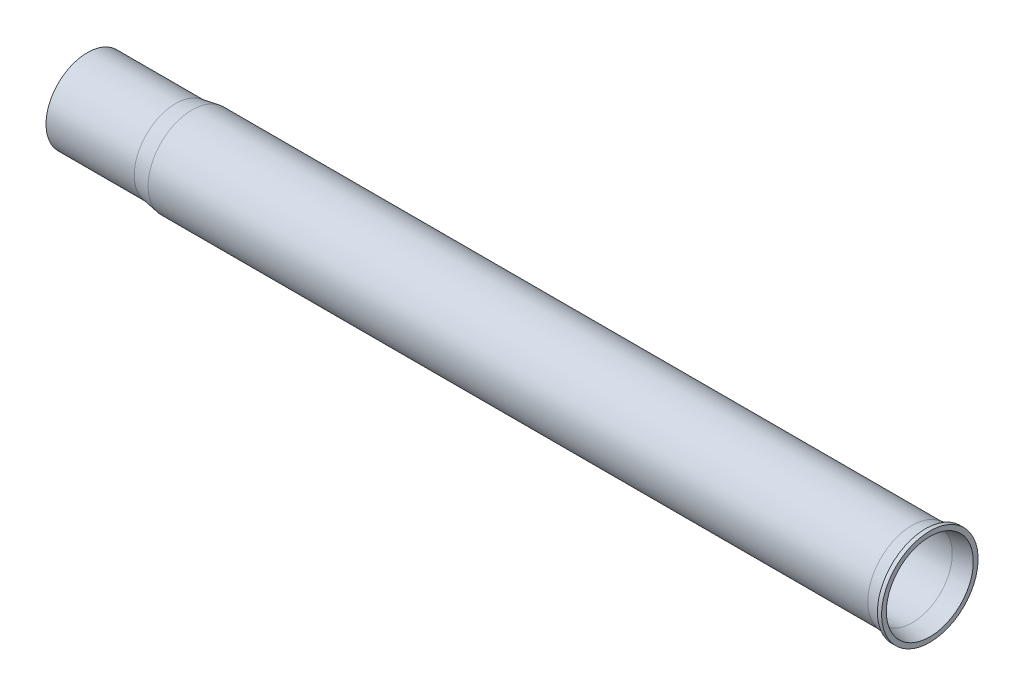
ISO-10303-21;
HEADER;
FILE_DESCRIPTION(('STEP AP214'),'2;1');
FILE_NAME('part.step','',(''),(''),'','','');
FILE_SCHEMA(('AUTOMOTIVE_DESIGN { 1 0 10303 214 1 1 1 1 }'));
ENDSEC;
DATA;
#1=APPLICATION_CONTEXT('core data for automotive mechanical design processes');
#2=APPLICATION_PROTOCOL_DEFINITION('international standard','automotive_design',2000,#1);
#3=PRODUCT_CONTEXT('',#1,'mechanical');
#4=PRODUCT('Part','Part','',(#3));
#5=PRODUCT_RELATED_PRODUCT_CATEGORY('part','',(#4));
#6=PRODUCT_DEFINITION_FORMATION('','',#4);
#7=PRODUCT_DEFINITION_CONTEXT('part definition',#1,'design');
#8=PRODUCT_DEFINITION('design','',#6,#7);
#9=PRODUCT_DEFINITION_SHAPE('','',#8);
#10=(LENGTH_UNIT() NAMED_UNIT(*) SI_UNIT(.MILLI.,.METRE.));
#11=(NAMED_UNIT(*) PLANE_ANGLE_UNIT() SI_UNIT($,.RADIAN.));
#12=(NAMED_UNIT(*) SI_UNIT($,.STERADIAN.) SOLID_ANGLE_UNIT());
#13=UNCERTAINTY_MEASURE_WITH_UNIT(LENGTH_MEASURE(1.E-05),#10,'distance_accuracy_value','');
#14=(GEOMETRIC_REPRESENTATION_CONTEXT(3) GLOBAL_UNCERTAINTY_ASSIGNED_CONTEXT((#13)) GLOBAL_UNIT_ASSIGNED_CONTEXT((#10,
#11,#12)) REPRESENTATION_CONTEXT('',''));
#15=CARTESIAN_POINT('',(0.,0.,0.));
#16=DIRECTION('',(0.,0.,1.));
#17=DIRECTION('',(1.,0.,0.));
#18=AXIS2_PLACEMENT_3D('',#15,#16,#17);
#19=CARTESIAN_POINT('',(0.,15.,0.));
#20=DIRECTION('',(1.,0.,0.));
#21=DIRECTION('',(0.,0.,-1.));
#22=AXIS2_PLACEMENT_3D('',#19,#20,#21);
#23=PLANE('',#22);
#24=CARTESIAN_POINT('',(0.,0.,0.));
#25=DIRECTION('',(-1.,0.,0.));
#26=DIRECTION('',(0.,0.,1.));
#27=AXIS2_PLACEMENT_3D('',#24,#25,#26);
#28=CIRCLE('',#27,13.5);
#29=CARTESIAN_POINT('',(0.,0.,13.5));
#30=VERTEX_POINT('',#29);
#31=EDGE_CURVE('E10',#30,#30,#28,.T.);
#32=ORIENTED_EDGE('',*,*,#31,.F.);
#33=EDGE_LOOP('',(#32));
#34=FACE_BOUND('',#33,.T.);
#35=CARTESIAN_POINT('',(0.,0.,0.));
#36=DIRECTION('',(-1.,0.,0.));
#37=DIRECTION('',(0.,0.,1.));
#38=AXIS2_PLACEMENT_3D('',#35,#36,#37);
#39=CIRCLE('',#38,15.);
#40=CARTESIAN_POINT('',(0.,0.,15.));
#41=VERTEX_POINT('',#40);
#42=EDGE_CURVE('E69',#41,#41,#39,.T.);
#43=ORIENTED_EDGE('',*,*,#42,.T.);
#44=EDGE_LOOP('',(#43));
#45=FACE_BOUND('',#44,.T.);
#46=ADVANCED_FACE('F29',(#34,#45),#23,.F.);
#47=CARTESIAN_POINT('',(0.,0.,0.));
#48=DIRECTION('',(-1.,0.,0.));
#49=DIRECTION('',(0.,0.,1.));
#50=AXIS2_PLACEMENT_3D('',#47,#48,#49);
#51=CYLINDRICAL_SURFACE('',#50,13.5);
#52=CARTESIAN_POINT('',(32.1241437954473,0.,0.));
#53=DIRECTION('',(-1.,0.,0.));
#54=DIRECTION('',(0.,0.,1.));
#55=AXIS2_PLACEMENT_3D('',#52,#53,#54);
#56=CIRCLE('',#55,13.5);
#57=CARTESIAN_POINT('',(32.1241437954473,0.,13.5));
#58=VERTEX_POINT('',#57);
#59=EDGE_CURVE('E35',#58,#58,#56,.T.);
#60=ORIENTED_EDGE('',*,*,#59,.F.);
#61=EDGE_LOOP('',(#60));
#62=FACE_BOUND('',#61,.T.);
#63=ORIENTED_EDGE('',*,*,#31,.T.);
#64=EDGE_LOOP('',(#63));
#65=FACE_BOUND('',#64,.T.);
#66=ADVANCED_FACE('F130',(#62,#65),#51,.F.);
#67=CARTESIAN_POINT('',(32.1241437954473,0.,0.));
#68=DIRECTION('',(1.,0.,0.));
#69=DIRECTION('',(0.,0.,-1.));
#70=AXIS2_PLACEMENT_3D('',#67,#68,#69);
#71=CONICAL_SURFACE('',#70,13.5,0.165148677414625);
#72=CARTESIAN_POINT('',(38.1241437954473,0.,0.));
#73=DIRECTION('',(-1.,0.,0.));
#74=DIRECTION('',(0.,0.,1.));
#75=AXIS2_PLACEMENT_3D('',#72,#73,#74);
#76=CIRCLE('',#75,14.5);
#77=CARTESIAN_POINT('',(38.1241437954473,0.,14.5));
#78=VERTEX_POINT('',#77);
#79=EDGE_CURVE('E39',#78,#78,#76,.T.);
#80=ORIENTED_EDGE('',*,*,#79,.F.);
#81=EDGE_LOOP('',(#80));
#82=FACE_BOUND('',#81,.T.);
#83=ORIENTED_EDGE('',*,*,#59,.T.);
#84=EDGE_LOOP('',(#83));
#85=FACE_BOUND('',#84,.T.);
#86=ADVANCED_FACE('F125',(#82,#85),#71,.F.);
#87=CARTESIAN_POINT('',(0.,0.,0.));
#88=DIRECTION('',(-1.,0.,0.));
#89=DIRECTION('',(0.,0.,1.));
#90=AXIS2_PLACEMENT_3D('',#87,#88,#89);
#91=CYLINDRICAL_SURFACE('',#90,14.5);
#92=CARTESIAN_POINT('',(299.148529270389,0.,0.));
#93=DIRECTION('',(-1.,0.,0.));
#94=DIRECTION('',(0.,0.,1.));
#95=AXIS2_PLACEMENT_3D('',#92,#93,#94);
#96=CIRCLE('',#95,14.5);
#97=CARTESIAN_POINT('',(299.148529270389,0.,14.5));
#98=VERTEX_POINT('',#97);
#99=EDGE_CURVE('E43',#98,#98,#96,.T.);
#100=ORIENTED_EDGE('',*,*,#99,.F.);
#101=EDGE_LOOP('',(#100));
#102=FACE_BOUND('',#101,.T.);
#103=ORIENTED_EDGE('',*,*,#79,.T.);
#104=EDGE_LOOP('',(#103));
#105=FACE_BOUND('',#104,.T.);
#106=ADVANCED_FACE('F119',(#102,#105),#91,.F.);
#107=CARTESIAN_POINT('',(299.148529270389,0.,0.));
#108=DIRECTION('',(1.,0.,0.));
#109=DIRECTION('',(0.,0.,-1.));
#110=AXIS2_PLACEMENT_3D('',#107,#108,#109);
#111=CONICAL_SURFACE('',#110,14.5,0.197395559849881);
#112=CARTESIAN_POINT('',(305.5,0.,0.));
#113=DIRECTION('',(-1.,0.,0.));
#114=DIRECTION('',(0.,0.,1.));
#115=AXIS2_PLACEMENT_3D('',#112,#113,#114);
#116=CIRCLE('',#115,15.7702941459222);
#117=CARTESIAN_POINT('',(305.5,0.,15.7702941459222));
#118=VERTEX_POINT('',#117);
#119=EDGE_CURVE('E48',#118,#118,#116,.T.);
#120=ORIENTED_EDGE('',*,*,#119,.F.);
#121=EDGE_LOOP('',(#120));
#122=FACE_BOUND('',#121,.T.);
#123=ORIENTED_EDGE('',*,*,#99,.T.);
#124=EDGE_LOOP('',(#123));
#125=FACE_BOUND('',#124,.T.);
#126=ADVANCED_FACE('F113',(#122,#125),#111,.F.);
#127=CARTESIAN_POINT('',(305.5,17.5,0.));
#128=DIRECTION('',(-1.,0.,0.));
#129=DIRECTION('',(0.,0.,1.));
#130=AXIS2_PLACEMENT_3D('',#127,#128,#129);
#131=PLANE('',#130);
#132=CARTESIAN_POINT('',(305.5,0.,0.));
#133=DIRECTION('',(-1.,0.,0.));
#134=DIRECTION('',(0.,0.,1.));
#135=AXIS2_PLACEMENT_3D('',#132,#133,#134);
#136=CIRCLE('',#135,17.5);
#137=CARTESIAN_POINT('',(305.5,0.,17.5));
#138=VERTEX_POINT('',#137);
#139=EDGE_CURVE('E51',#138,#138,#136,.T.);
#140=ORIENTED_EDGE('',*,*,#139,.F.);
#141=EDGE_LOOP('',(#140));
#142=FACE_BOUND('',#141,.T.);
#143=ORIENTED_EDGE('',*,*,#119,.T.);
#144=EDGE_LOOP('',(#143));
#145=FACE_BOUND('',#144,.T.);
#146=ADVANCED_FACE('F107',(#142,#145),#131,.F.);
#147=CARTESIAN_POINT('',(0.,0.,0.));
#148=DIRECTION('',(-1.,0.,0.));
#149=DIRECTION('',(0.,0.,1.));
#150=AXIS2_PLACEMENT_3D('',#147,#148,#149);
#151=CYLINDRICAL_SURFACE('',#150,17.5);
#152=CARTESIAN_POINT('',(304.,0.,0.));
#153=DIRECTION('',(-1.,0.,0.));
#154=DIRECTION('',(0.,0.,1.));
#155=AXIS2_PLACEMENT_3D('',#152,#153,#154);
#156=CIRCLE('',#155,17.5);
#157=CARTESIAN_POINT('',(304.,0.,17.5));
#158=VERTEX_POINT('',#157);
#159=EDGE_CURVE('E54',#158,#158,#156,.T.);
#160=ORIENTED_EDGE('',*,*,#159,.F.);
#161=EDGE_LOOP('',(#160));
#162=FACE_BOUND('',#161,.T.);
#163=ORIENTED_EDGE('',*,*,#139,.T.);
#164=EDGE_LOOP('',(#163));
#165=FACE_BOUND('',#164,.T.);
#166=ADVANCED_FACE('F101',(#162,#165),#151,.T.);
#167=CARTESIAN_POINT('',(304.,17.,0.));
#168=DIRECTION('',(1.,0.,0.));
#169=DIRECTION('',(0.,0.,-1.));
#170=AXIS2_PLACEMENT_3D('',#167,#168,#169);
#171=PLANE('',#170);
#172=CARTESIAN_POINT('',(304.,0.,0.));
#173=DIRECTION('',(-1.,0.,0.));
#174=DIRECTION('',(0.,0.,1.));
#175=AXIS2_PLACEMENT_3D('',#172,#173,#174);
#176=CIRCLE('',#175,17.);
#177=CARTESIAN_POINT('',(304.,0.,17.));
#178=VERTEX_POINT('',#177);
#179=EDGE_CURVE('E57',#178,#178,#176,.T.);
#180=ORIENTED_EDGE('',*,*,#179,.F.);
#181=EDGE_LOOP('',(#180));
#182=FACE_BOUND('',#181,.T.);
#183=ORIENTED_EDGE('',*,*,#159,.T.);
#184=EDGE_LOOP('',(#183));
#185=FACE_BOUND('',#184,.T.);
#186=ADVANCED_FACE('F95',(#182,#185),#171,.F.);
#187=CARTESIAN_POINT('',(304.,0.,0.));
#188=DIRECTION('',(1.,0.,0.));
#189=DIRECTION('',(0.,0.,-1.));
#190=AXIS2_PLACEMENT_3D('',#187,#188,#189);
#191=CONICAL_SURFACE('',#190,17.,0.197395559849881);
#192=CARTESIAN_POINT('',(299.,0.,0.));
#193=DIRECTION('',(-1.,0.,0.));
#194=DIRECTION('',(0.,0.,1.));
#195=AXIS2_PLACEMENT_3D('',#192,#193,#194);
#196=CIRCLE('',#195,16.);
#197=CARTESIAN_POINT('',(299.,0.,16.));
#198=VERTEX_POINT('',#197);
#199=EDGE_CURVE('E60',#198,#198,#196,.T.);
#200=ORIENTED_EDGE('',*,*,#199,.F.);
#201=EDGE_LOOP('',(#200));
#202=FACE_BOUND('',#201,.T.);
#203=ORIENTED_EDGE('',*,*,#179,.T.);
#204=EDGE_LOOP('',(#203));
#205=FACE_BOUND('',#204,.T.);
#206=ADVANCED_FACE('F89',(#202,#205),#191,.T.);
#207=CARTESIAN_POINT('',(0.,0.,0.));
#208=DIRECTION('',(-1.,0.,0.));
#209=DIRECTION('',(0.,0.,1.));
#210=AXIS2_PLACEMENT_3D('',#207,#208,#209);
#211=CYLINDRICAL_SURFACE('',#210,16.);
#212=CARTESIAN_POINT('',(38.,0.,0.));
#213=DIRECTION('',(-1.,0.,0.));
#214=DIRECTION('',(0.,0.,1.));
#215=AXIS2_PLACEMENT_3D('',#212,#213,#214);
#216=CIRCLE('',#215,16.);
#217=CARTESIAN_POINT('',(38.,0.,16.));
#218=VERTEX_POINT('',#217);
#219=EDGE_CURVE('E63',#218,#218,#216,.T.);
#220=ORIENTED_EDGE('',*,*,#219,.F.);
#221=EDGE_LOOP('',(#220));
#222=FACE_BOUND('',#221,.T.);
#223=ORIENTED_EDGE('',*,*,#199,.T.);
#224=EDGE_LOOP('',(#223));
#225=FACE_BOUND('',#224,.T.);
#226=ADVANCED_FACE('F83',(#222,#225),#211,.T.);
#227=CARTESIAN_POINT('',(38.,0.,0.));
#228=DIRECTION('',(1.,0.,0.));
#229=DIRECTION('',(0.,0.,-1.));
#230=AXIS2_PLACEMENT_3D('',#227,#228,#229);
#231=CONICAL_SURFACE('',#230,16.,0.165148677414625);
#232=CARTESIAN_POINT('',(32.,0.,0.));
#233=DIRECTION('',(-1.,0.,0.));
#234=DIRECTION('',(0.,0.,1.));
#235=AXIS2_PLACEMENT_3D('',#232,#233,#234);
#236=CIRCLE('',#235,15.);
#237=CARTESIAN_POINT('',(32.,0.,15.));
#238=VERTEX_POINT('',#237);
#239=EDGE_CURVE('E66',#238,#238,#236,.T.);
#240=ORIENTED_EDGE('',*,*,#239,.F.);
#241=EDGE_LOOP('',(#240));
#242=FACE_BOUND('',#241,.T.);
#243=ORIENTED_EDGE('',*,*,#219,.T.);
#244=EDGE_LOOP('',(#243));
#245=FACE_BOUND('',#244,.T.);
#246=ADVANCED_FACE('F77',(#242,#245),#231,.T.);
#247=CARTESIAN_POINT('',(0.,0.,0.));
#248=DIRECTION('',(-1.,0.,0.));
#249=DIRECTION('',(0.,0.,1.));
#250=AXIS2_PLACEMENT_3D('',#247,#248,#249);
#251=CYLINDRICAL_SURFACE('',#250,15.);
#252=ORIENTED_EDGE('',*,*,#42,.F.);
#253=EDGE_LOOP('',(#252));
#254=FACE_BOUND('',#253,.T.);
#255=ORIENTED_EDGE('',*,*,#239,.T.);
#256=EDGE_LOOP('',(#255));
#257=FACE_BOUND('',#256,.T.);
#258=ADVANCED_FACE('F74',(#254,#257),#251,.T.);
#259=CLOSED_SHELL('',(#46,#66,#86,#106,#126,#146,#166,#186,#206,#226,#246,#258));
#260=MANIFOLD_SOLID_BREP('B2',#259);
#261=ADVANCED_BREP_SHAPE_REPRESENTATION('',(#18,#260),#14);
#262=SHAPE_DEFINITION_REPRESENTATION(#9,#261);
ENDSEC;
END-ISO-10303-21;
